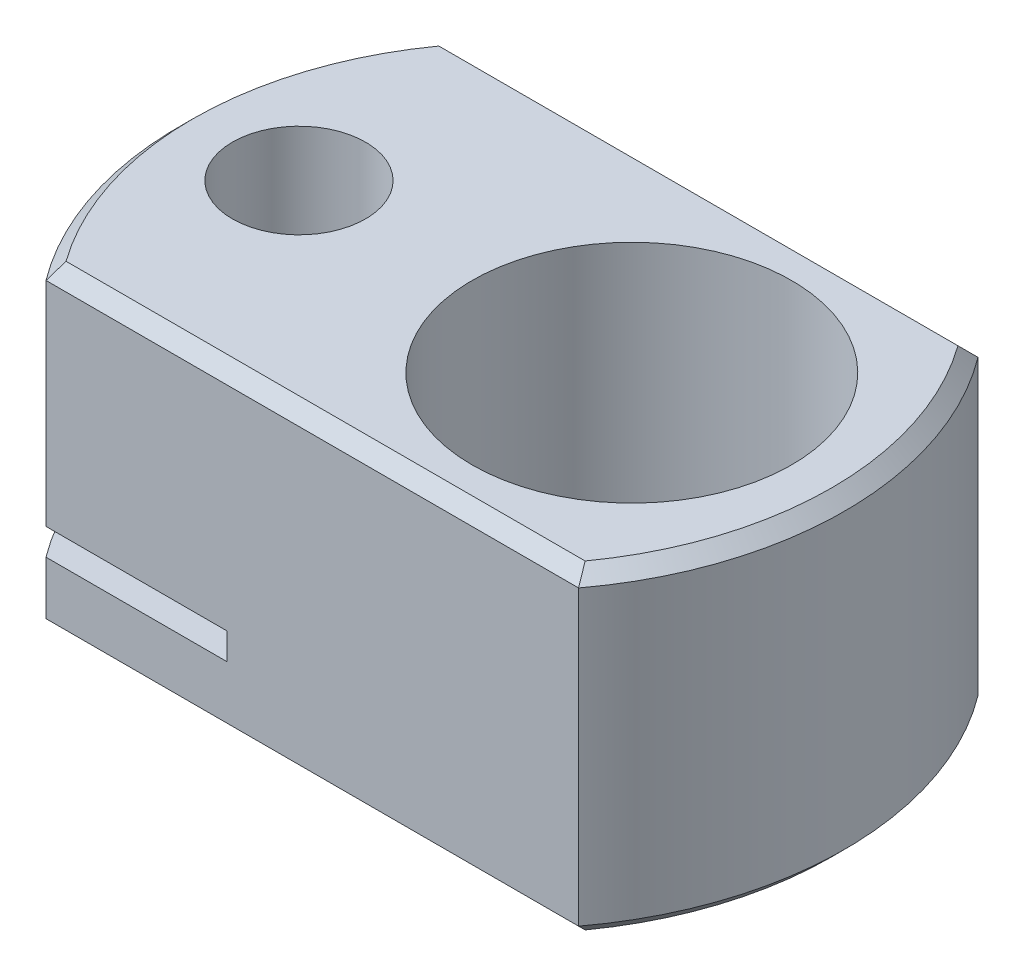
ISO-10303-21;
HEADER;
FILE_DESCRIPTION(('STEP AP214'),'2;1');
FILE_NAME('part.step','',(''),(''),'','','');
FILE_SCHEMA(('AUTOMOTIVE_DESIGN { 1 0 10303 214 1 1 1 1 }'));
ENDSEC;
DATA;
#1=APPLICATION_CONTEXT('core data for automotive mechanical design processes');
#2=APPLICATION_PROTOCOL_DEFINITION('international standard','automotive_design',2000,#1);
#3=PRODUCT_CONTEXT('',#1,'mechanical');
#4=PRODUCT('Part','Part','',(#3));
#5=PRODUCT_RELATED_PRODUCT_CATEGORY('part','',(#4));
#6=PRODUCT_DEFINITION_FORMATION('','',#4);
#7=PRODUCT_DEFINITION_CONTEXT('part definition',#1,'design');
#8=PRODUCT_DEFINITION('design','',#6,#7);
#9=PRODUCT_DEFINITION_SHAPE('','',#8);
#10=(LENGTH_UNIT() NAMED_UNIT(*) SI_UNIT(.MILLI.,.METRE.));
#11=(NAMED_UNIT(*) PLANE_ANGLE_UNIT() SI_UNIT($,.RADIAN.));
#12=(NAMED_UNIT(*) SI_UNIT($,.STERADIAN.) SOLID_ANGLE_UNIT());
#13=UNCERTAINTY_MEASURE_WITH_UNIT(LENGTH_MEASURE(1.E-05),#10,'distance_accuracy_value','');
#14=(GEOMETRIC_REPRESENTATION_CONTEXT(3) GLOBAL_UNCERTAINTY_ASSIGNED_CONTEXT((#13)) GLOBAL_UNIT_ASSIGNED_CONTEXT((#10,
#11,#12)) REPRESENTATION_CONTEXT('',''));
#15=CARTESIAN_POINT('',(0.,0.,0.));
#16=DIRECTION('',(0.,0.,1.));
#17=DIRECTION('',(1.,0.,0.));
#18=AXIS2_PLACEMENT_3D('',#15,#16,#17);
#19=CARTESIAN_POINT('',(0.,12.,0.));
#20=DIRECTION('',(0.,-1.,0.));
#21=DIRECTION('',(0.,0.,-1.));
#22=AXIS2_PLACEMENT_3D('',#19,#20,#21);
#23=CYLINDRICAL_SURFACE('',#22,12.5);
#24=DIRECTION('',(0.,-1.,0.));
#25=VECTOR('',#24,1.);
#26=CARTESIAN_POINT('',(-10.,12.,-7.50000000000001));
#27=LINE('',#26,#25);
#28=CARTESIAN_POINT('',(-10.,11.5,-7.50000000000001));
#29=VERTEX_POINT('',#28);
#30=CARTESIAN_POINT('',(-10.,3.49999999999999,-7.5));
#31=VERTEX_POINT('',#30);
#32=EDGE_CURVE('E255',#29,#31,#27,.T.);
#33=ORIENTED_EDGE('',*,*,#32,.T.);
#34=CARTESIAN_POINT('',(0.,3.5,0.));
#35=DIRECTION('',(0.,1.,0.));
#36=DIRECTION('',(-1.,0.,0.));
#37=AXIS2_PLACEMENT_3D('',#34,#35,#36);
#38=CIRCLE('',#37,12.5);
#39=CARTESIAN_POINT('',(-10.,3.49999999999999,7.50000000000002));
#40=VERTEX_POINT('',#39);
#41=EDGE_CURVE('E151',#31,#40,#38,.T.);
#42=ORIENTED_EDGE('',*,*,#41,.T.);
#43=DIRECTION('',(0.,-1.,0.));
#44=VECTOR('',#43,1.);
#45=CARTESIAN_POINT('',(-10.,12.,7.50000000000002));
#46=LINE('',#45,#44);
#47=CARTESIAN_POINT('',(-10.,11.5,7.50000000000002));
#48=VERTEX_POINT('',#47);
#49=EDGE_CURVE('E252',#48,#40,#46,.T.);
#50=ORIENTED_EDGE('',*,*,#49,.F.);
#51=CARTESIAN_POINT('',(0.,11.5,0.));
#52=DIRECTION('',(0.,1.,0.));
#53=DIRECTION('',(0.,0.,1.));
#54=AXIS2_PLACEMENT_3D('',#51,#52,#53);
#55=CIRCLE('',#54,12.5);
#56=EDGE_CURVE('E278',#48,#29,#55,.F.);
#57=ORIENTED_EDGE('',*,*,#56,.T.);
#58=EDGE_LOOP('',(#33,#42,#50,#57));
#59=FACE_BOUND('',#58,.T.);
#60=ADVANCED_FACE('F30',(#59),#23,.T.);
#61=CARTESIAN_POINT('',(-8.00000000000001,12.,0.));
#62=DIRECTION('',(0.,-1.,0.));
#63=DIRECTION('',(0.,0.,-1.));
#64=AXIS2_PLACEMENT_3D('',#61,#62,#63);
#65=CYLINDRICAL_SURFACE('',#64,2.5);
#66=CARTESIAN_POINT('',(-8.00000000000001,3.49999999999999,0.));
#67=DIRECTION('',(0.,1.,0.));
#68=DIRECTION('',(-1.,0.,0.));
#69=AXIS2_PLACEMENT_3D('',#66,#67,#68);
#70=CIRCLE('',#69,2.5);
#71=CARTESIAN_POINT('',(-10.5,3.49999999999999,0.));
#72=VERTEX_POINT('',#71);
#73=EDGE_CURVE('E147',#72,#72,#70,.T.);
#74=ORIENTED_EDGE('',*,*,#73,.F.);
#75=EDGE_LOOP('',(#74));
#76=FACE_BOUND('',#75,.T.);
#77=CARTESIAN_POINT('',(-8.00000000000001,12.,0.));
#78=DIRECTION('',(0.,1.,0.));
#79=DIRECTION('',(0.,0.,1.));
#80=AXIS2_PLACEMENT_3D('',#77,#78,#79);
#81=CIRCLE('',#80,2.5);
#82=CARTESIAN_POINT('',(-8.00000000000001,12.,2.50000000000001));
#83=VERTEX_POINT('',#82);
#84=EDGE_CURVE('E157',#83,#83,#81,.T.);
#85=ORIENTED_EDGE('',*,*,#84,.T.);
#86=EDGE_LOOP('',(#85));
#87=FACE_BOUND('',#86,.T.);
#88=ADVANCED_FACE('F301',(#76,#87),#65,.F.);
#89=CARTESIAN_POINT('',(0.,12.,0.));
#90=DIRECTION('',(0.,1.,0.));
#91=DIRECTION('',(0.,0.,1.));
#92=AXIS2_PLACEMENT_3D('',#89,#90,#91);
#93=PLANE('',#92);
#94=CARTESIAN_POINT('',(4.5,12.,0.));
#95=DIRECTION('',(0.,1.,0.));
#96=DIRECTION('',(0.,0.,1.));
#97=AXIS2_PLACEMENT_3D('',#94,#95,#96);
#98=CIRCLE('',#97,6.);
#99=CARTESIAN_POINT('',(4.5,12.,6.));
#100=VERTEX_POINT('',#99);
#101=EDGE_CURVE('E163',#100,#100,#98,.T.);
#102=ORIENTED_EDGE('',*,*,#101,.F.);
#103=EDGE_LOOP('',(#102));
#104=FACE_BOUND('',#103,.T.);
#105=CARTESIAN_POINT('',(0.,12.,0.));
#106=DIRECTION('',(0.,1.,0.));
#107=DIRECTION('',(0.,0.,1.));
#108=AXIS2_PLACEMENT_3D('',#105,#106,#107);
#109=CIRCLE('',#108,12.);
#110=CARTESIAN_POINT('',(-9.74679434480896,12.,-7.));
#111=VERTEX_POINT('',#110);
#112=CARTESIAN_POINT('',(-9.74679434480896,12.,7.));
#113=VERTEX_POINT('',#112);
#114=EDGE_CURVE('E265',#111,#113,#109,.T.);
#115=ORIENTED_EDGE('',*,*,#114,.T.);
#116=DIRECTION('',(1.,0.,0.));
#117=VECTOR('',#116,1.);
#118=CARTESIAN_POINT('',(10.,12.,7.00000000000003));
#119=LINE('',#118,#117);
#120=CARTESIAN_POINT('',(9.74679434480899,12.,7.00000000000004));
#121=VERTEX_POINT('',#120);
#122=EDGE_CURVE('E267',#113,#121,#119,.T.);
#123=ORIENTED_EDGE('',*,*,#122,.T.);
#124=CARTESIAN_POINT('',(0.,12.,0.));
#125=DIRECTION('',(0.,1.,0.));
#126=DIRECTION('',(0.,0.,1.));
#127=AXIS2_PLACEMENT_3D('',#124,#125,#126);
#128=CIRCLE('',#127,12.);
#129=CARTESIAN_POINT('',(9.74679434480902,12.,-7.00000000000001));
#130=VERTEX_POINT('',#129);
#131=EDGE_CURVE('E261',#121,#130,#128,.T.);
#132=ORIENTED_EDGE('',*,*,#131,.T.);
#133=DIRECTION('',(-1.,0.,0.));
#134=VECTOR('',#133,1.);
#135=CARTESIAN_POINT('',(-9.99999999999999,12.,-7.));
#136=LINE('',#135,#134);
#137=EDGE_CURVE('E263',#130,#111,#136,.T.);
#138=ORIENTED_EDGE('',*,*,#137,.T.);
#139=EDGE_LOOP('',(#115,#123,#132,#138));
#140=FACE_BOUND('',#139,.T.);
#141=ORIENTED_EDGE('',*,*,#84,.F.);
#142=EDGE_LOOP('',(#141));
#143=FACE_BOUND('',#142,.T.);
#144=ADVANCED_FACE('F304',(#104,#140,#143),#93,.T.);
#145=CARTESIAN_POINT('',(0.,0.,0.));
#146=DIRECTION('',(0.,1.,0.));
#147=DIRECTION('',(0.,0.,1.));
#148=AXIS2_PLACEMENT_3D('',#145,#146,#147);
#149=PLANE('',#148);
#150=CARTESIAN_POINT('',(4.5,0.,0.));
#151=DIRECTION('',(0.,1.,0.));
#152=DIRECTION('',(0.,0.,1.));
#153=AXIS2_PLACEMENT_3D('',#150,#151,#152);
#154=CIRCLE('',#153,6.);
#155=CARTESIAN_POINT('',(4.5,0.,6.));
#156=VERTEX_POINT('',#155);
#157=EDGE_CURVE('E160',#156,#156,#154,.T.);
#158=ORIENTED_EDGE('',*,*,#157,.T.);
#159=EDGE_LOOP('',(#158));
#160=FACE_BOUND('',#159,.T.);
#161=CARTESIAN_POINT('',(0.,0.,0.));
#162=DIRECTION('',(0.,1.,0.));
#163=DIRECTION('',(0.,0.,1.));
#164=AXIS2_PLACEMENT_3D('',#161,#162,#163);
#165=CIRCLE('',#164,12.);
#166=CARTESIAN_POINT('',(-9.74679434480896,0.,7.));
#167=VERTEX_POINT('',#166);
#168=CARTESIAN_POINT('',(-9.74679434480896,0.,-7.));
#169=VERTEX_POINT('',#168);
#170=EDGE_CURVE('E53',#167,#169,#165,.F.);
#171=ORIENTED_EDGE('',*,*,#170,.T.);
#172=DIRECTION('',(1.,0.,0.));
#173=VECTOR('',#172,1.);
#174=CARTESIAN_POINT('',(0.,0.,-7.));
#175=LINE('',#174,#173);
#176=CARTESIAN_POINT('',(9.74679434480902,0.,-7.00000000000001));
#177=VERTEX_POINT('',#176);
#178=EDGE_CURVE('E38',#169,#177,#175,.T.);
#179=ORIENTED_EDGE('',*,*,#178,.T.);
#180=CARTESIAN_POINT('',(0.,0.,0.));
#181=DIRECTION('',(0.,1.,0.));
#182=DIRECTION('',(0.,0.,1.));
#183=AXIS2_PLACEMENT_3D('',#180,#181,#182);
#184=CIRCLE('',#183,12.);
#185=CARTESIAN_POINT('',(9.74679434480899,0.,7.00000000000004));
#186=VERTEX_POINT('',#185);
#187=EDGE_CURVE('E288',#177,#186,#184,.F.);
#188=ORIENTED_EDGE('',*,*,#187,.T.);
#189=DIRECTION('',(-1.,0.,0.));
#190=VECTOR('',#189,1.);
#191=CARTESIAN_POINT('',(0.,0.,7.));
#192=LINE('',#191,#190);
#193=EDGE_CURVE('E290',#186,#167,#192,.T.);
#194=ORIENTED_EDGE('',*,*,#193,.T.);
#195=EDGE_LOOP('',(#171,#179,#188,#194));
#196=FACE_BOUND('',#195,.T.);
#197=CARTESIAN_POINT('',(-8.00000000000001,0.,0.));
#198=DIRECTION('',(0.,1.,0.));
#199=DIRECTION('',(0.,0.,1.));
#200=AXIS2_PLACEMENT_3D('',#197,#198,#199);
#201=CIRCLE('',#200,2.5);
#202=CARTESIAN_POINT('',(-8.00000000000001,0.,2.50000000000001));
#203=VERTEX_POINT('',#202);
#204=EDGE_CURVE('E154',#203,#203,#201,.T.);
#205=ORIENTED_EDGE('',*,*,#204,.T.);
#206=EDGE_LOOP('',(#205));
#207=FACE_BOUND('',#206,.T.);
#208=ADVANCED_FACE('F310',(#160,#196,#207),#149,.F.);
#209=CARTESIAN_POINT('',(0.,12.,0.));
#210=DIRECTION('',(0.,-1.,0.));
#211=DIRECTION('',(0.,0.,-1.));
#212=AXIS2_PLACEMENT_3D('',#209,#210,#211);
#213=CYLINDRICAL_SURFACE('',#212,12.5);
#214=DIRECTION('',(0.,-1.,0.));
#215=VECTOR('',#214,1.);
#216=CARTESIAN_POINT('',(10.,12.,-7.5));
#217=LINE('',#216,#215);
#218=CARTESIAN_POINT('',(10.,11.5,-7.5));
#219=VERTEX_POINT('',#218);
#220=CARTESIAN_POINT('',(10.,0.5,-7.5));
#221=VERTEX_POINT('',#220);
#222=EDGE_CURVE('E258',#219,#221,#217,.T.);
#223=ORIENTED_EDGE('',*,*,#222,.F.);
#224=CARTESIAN_POINT('',(0.,11.5,0.));
#225=DIRECTION('',(0.,1.,0.));
#226=DIRECTION('',(0.,0.,1.));
#227=AXIS2_PLACEMENT_3D('',#224,#225,#226);
#228=CIRCLE('',#227,12.5);
#229=CARTESIAN_POINT('',(10.,11.5,7.50000000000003));
#230=VERTEX_POINT('',#229);
#231=EDGE_CURVE('E286',#219,#230,#228,.F.);
#232=ORIENTED_EDGE('',*,*,#231,.T.);
#233=DIRECTION('',(0.,-1.,0.));
#234=VECTOR('',#233,1.);
#235=CARTESIAN_POINT('',(10.,12.,7.50000000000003));
#236=LINE('',#235,#234);
#237=CARTESIAN_POINT('',(10.,0.5,7.50000000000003));
#238=VERTEX_POINT('',#237);
#239=EDGE_CURVE('E244',#230,#238,#236,.T.);
#240=ORIENTED_EDGE('',*,*,#239,.T.);
#241=CARTESIAN_POINT('',(0.,0.5,0.));
#242=DIRECTION('',(0.,1.,0.));
#243=DIRECTION('',(0.,0.,1.));
#244=AXIS2_PLACEMENT_3D('',#241,#242,#243);
#245=CIRCLE('',#244,12.5);
#246=EDGE_CURVE('E284',#238,#221,#245,.T.);
#247=ORIENTED_EDGE('',*,*,#246,.T.);
#248=EDGE_LOOP('',(#223,#232,#240,#247));
#249=FACE_BOUND('',#248,.T.);
#250=ADVANCED_FACE('F32',(#249),#213,.T.);
#251=CARTESIAN_POINT('',(-10.,12.,-7.5));
#252=DIRECTION('',(0.,0.,1.));
#253=DIRECTION('',(1.,0.,0.));
#254=AXIS2_PLACEMENT_3D('',#251,#252,#253);
#255=PLANE('',#254);
#256=DIRECTION('',(0.,1.,0.));
#257=VECTOR('',#256,1.);
#258=CARTESIAN_POINT('',(-3.1971816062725,3.49999999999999,-7.50000000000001));
#259=LINE('',#258,#257);
#260=CARTESIAN_POINT('',(-3.1971816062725,2.5,-7.50000000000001));
#261=VERTEX_POINT('',#260);
#262=CARTESIAN_POINT('',(-3.1971816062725,3.49999999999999,-7.50000000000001));
#263=VERTEX_POINT('',#262);
#264=EDGE_CURVE('E129',#261,#263,#259,.T.);
#265=ORIENTED_EDGE('',*,*,#264,.T.);
#266=DIRECTION('',(-1.,0.,0.));
#267=VECTOR('',#266,1.);
#268=CARTESIAN_POINT('',(-15.1971816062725,3.49999999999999,-7.50000000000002));
#269=LINE('',#268,#267);
#270=EDGE_CURVE('E126',#263,#31,#269,.T.);
#271=ORIENTED_EDGE('',*,*,#270,.T.);
#272=ORIENTED_EDGE('',*,*,#32,.F.);
#273=DIRECTION('',(1.,0.,0.));
#274=VECTOR('',#273,1.);
#275=CARTESIAN_POINT('',(10.,11.5,-7.5));
#276=LINE('',#275,#274);
#277=EDGE_CURVE('E282',#29,#219,#276,.T.);
#278=ORIENTED_EDGE('',*,*,#277,.T.);
#279=ORIENTED_EDGE('',*,*,#222,.T.);
#280=DIRECTION('',(-1.,0.,0.));
#281=VECTOR('',#280,1.);
#282=CARTESIAN_POINT('',(-10.,0.5,-7.5));
#283=LINE('',#282,#281);
#284=CARTESIAN_POINT('',(-10.,0.5,-7.50000000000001));
#285=VERTEX_POINT('',#284);
#286=EDGE_CURVE('E280',#221,#285,#283,.T.);
#287=ORIENTED_EDGE('',*,*,#286,.T.);
#288=CARTESIAN_POINT('',(-10.,2.5,-7.5));
#289=VERTEX_POINT('',#288);
#290=EDGE_CURVE('E139',#289,#285,#27,.T.);
#291=ORIENTED_EDGE('',*,*,#290,.F.);
#292=DIRECTION('',(1.,0.,0.));
#293=VECTOR('',#292,1.);
#294=CARTESIAN_POINT('',(-15.1971816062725,2.49999999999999,-7.50000000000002));
#295=LINE('',#294,#293);
#296=EDGE_CURVE('E122',#289,#261,#295,.T.);
#297=ORIENTED_EDGE('',*,*,#296,.T.);
#298=EDGE_LOOP('',(#265,#271,#272,#278,#279,#287,#291,#297));
#299=FACE_BOUND('',#298,.T.);
#300=ADVANCED_FACE('F137',(#299),#255,.F.);
#301=CARTESIAN_POINT('',(-10.,2.5,7.50000000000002));
#302=VERTEX_POINT('',#301);
#303=CARTESIAN_POINT('',(-10.,0.5,7.50000000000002));
#304=VERTEX_POINT('',#303);
#305=EDGE_CURVE('E251',#302,#304,#46,.T.);
#306=ORIENTED_EDGE('',*,*,#305,.F.);
#307=CARTESIAN_POINT('',(0.,2.5,0.));
#308=DIRECTION('',(0.,-1.,0.));
#309=DIRECTION('',(1.,0.,0.));
#310=AXIS2_PLACEMENT_3D('',#307,#308,#309);
#311=CIRCLE('',#310,12.5);
#312=EDGE_CURVE('E45',#302,#289,#311,.T.);
#313=ORIENTED_EDGE('',*,*,#312,.T.);
#314=ORIENTED_EDGE('',*,*,#290,.T.);
#315=CARTESIAN_POINT('',(0.,0.5,0.));
#316=DIRECTION('',(0.,1.,0.));
#317=DIRECTION('',(0.,0.,1.));
#318=AXIS2_PLACEMENT_3D('',#315,#316,#317);
#319=CIRCLE('',#318,12.5);
#320=EDGE_CURVE('E275',#285,#304,#319,.T.);
#321=ORIENTED_EDGE('',*,*,#320,.T.);
#322=EDGE_LOOP('',(#306,#313,#314,#321));
#323=FACE_BOUND('',#322,.T.);
#324=ADVANCED_FACE('F323',(#323),#23,.T.);
#325=CARTESIAN_POINT('',(-10.,12.,7.50000000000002));
#326=DIRECTION('',(0.,0.,-1.));
#327=DIRECTION('',(-1.,0.,0.));
#328=AXIS2_PLACEMENT_3D('',#325,#326,#327);
#329=PLANE('',#328);
#330=ORIENTED_EDGE('',*,*,#49,.T.);
#331=DIRECTION('',(1.,0.,0.));
#332=VECTOR('',#331,1.);
#333=CARTESIAN_POINT('',(-10.,3.49999999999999,7.50000000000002));
#334=LINE('',#333,#332);
#335=CARTESIAN_POINT('',(-3.19718160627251,3.49999999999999,7.50000000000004));
#336=VERTEX_POINT('',#335);
#337=EDGE_CURVE('E148',#40,#336,#334,.T.);
#338=ORIENTED_EDGE('',*,*,#337,.T.);
#339=DIRECTION('',(0.,-1.,0.));
#340=VECTOR('',#339,1.);
#341=CARTESIAN_POINT('',(-3.19718160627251,12.,7.50000000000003));
#342=LINE('',#341,#340);
#343=CARTESIAN_POINT('',(-3.19718160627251,2.5,7.50000000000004));
#344=VERTEX_POINT('',#343);
#345=EDGE_CURVE('E11',#336,#344,#342,.T.);
#346=ORIENTED_EDGE('',*,*,#345,.T.);
#347=DIRECTION('',(-1.,0.,0.));
#348=VECTOR('',#347,1.);
#349=CARTESIAN_POINT('',(-9.99999999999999,2.5,7.50000000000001));
#350=LINE('',#349,#348);
#351=EDGE_CURVE('E123',#344,#302,#350,.T.);
#352=ORIENTED_EDGE('',*,*,#351,.T.);
#353=ORIENTED_EDGE('',*,*,#305,.T.);
#354=DIRECTION('',(1.,0.,0.));
#355=VECTOR('',#354,1.);
#356=CARTESIAN_POINT('',(-10.,0.5,7.50000000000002));
#357=LINE('',#356,#355);
#358=EDGE_CURVE('E270',#304,#238,#357,.T.);
#359=ORIENTED_EDGE('',*,*,#358,.T.);
#360=ORIENTED_EDGE('',*,*,#239,.F.);
#361=DIRECTION('',(-1.,0.,0.));
#362=VECTOR('',#361,1.);
#363=CARTESIAN_POINT('',(-10.,11.5,7.50000000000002));
#364=LINE('',#363,#362);
#365=EDGE_CURVE('E272',#230,#48,#364,.T.);
#366=ORIENTED_EDGE('',*,*,#365,.T.);
#367=EDGE_LOOP('',(#330,#338,#346,#352,#353,#359,#360,#366));
#368=FACE_BOUND('',#367,.T.);
#369=ADVANCED_FACE('F327',(#368),#329,.F.);
#370=CARTESIAN_POINT('',(0.,12.,-7.));
#371=DIRECTION('',(0.,0.707106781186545,-0.707106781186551));
#372=DIRECTION('',(0.,0.70710678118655,0.707106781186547));
#373=AXIS2_PLACEMENT_3D('',#370,#371,#372);
#374=PLANE('',#373);
#375=CARTESIAN_POINT('',(10.,11.5,-7.5));
#376=CARTESIAN_POINT('',(9.95827867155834,11.583454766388,-7.41654523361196));
#377=CARTESIAN_POINT('',(9.91631753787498,11.6668488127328,-7.33315118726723));
#378=CARTESIAN_POINT('',(9.83191565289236,11.83351547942,-7.16648452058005));
#379=CARTESIAN_POINT('',(9.78947490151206,11.9167880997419,-7.08321190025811));
#380=CARTESIAN_POINT('',(9.74679434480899,12.,-7.00000000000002));
#381=B_SPLINE_CURVE_WITH_KNOTS('',3,(#375,#376,#377,#378,#379,#380),.UNSPECIFIED.,.F.,.F.,(4,2,
4),(0.,0.375538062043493,0.751076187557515),.UNSPECIFIED.);
#382=EDGE_CURVE('E245',#219,#130,#381,.T.);
#383=ORIENTED_EDGE('',*,*,#382,.F.);
#384=ORIENTED_EDGE('',*,*,#277,.F.);
#385=CARTESIAN_POINT('',(-10.,11.5,-7.50000000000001));
#386=CARTESIAN_POINT('',(-9.95827867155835,11.583454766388,-7.41654523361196));
#387=CARTESIAN_POINT('',(-9.91631753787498,11.6668488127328,-7.33315118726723));
#388=CARTESIAN_POINT('',(-9.83191565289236,11.83351547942,-7.16648452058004));
#389=CARTESIAN_POINT('',(-9.78947490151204,11.9167880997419,-7.0832119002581));
#390=CARTESIAN_POINT('',(-9.74679434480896,12.,-7.));
#391=B_SPLINE_CURVE_WITH_KNOTS('',3,(#385,#386,#387,#388,#389,#390),.UNSPECIFIED.,.F.,.F.,(4,2,
4),(0.,0.375538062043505,0.751076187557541),.UNSPECIFIED.);
#392=EDGE_CURVE('E238',#111,#29,#391,.F.);
#393=ORIENTED_EDGE('',*,*,#392,.F.);
#394=ORIENTED_EDGE('',*,*,#137,.F.);
#395=EDGE_LOOP('',(#383,#384,#393,#394));
#396=FACE_BOUND('',#395,.T.);
#397=ADVANCED_FACE('F232',(#396),#374,.T.);
#398=CARTESIAN_POINT('',(0.,12.,0.));
#399=DIRECTION('',(0.,-1.,0.));
#400=DIRECTION('',(0.,0.,-1.));
#401=AXIS2_PLACEMENT_3D('',#398,#399,#400);
#402=CONICAL_SURFACE('',#401,12.,0.785398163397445);
#403=ORIENTED_EDGE('',*,*,#392,.T.);
#404=ORIENTED_EDGE('',*,*,#56,.F.);
#405=CARTESIAN_POINT('',(-10.,11.5,7.50000000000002));
#406=CARTESIAN_POINT('',(-9.95827867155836,11.583454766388,7.41654523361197));
#407=CARTESIAN_POINT('',(-9.91631753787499,11.6668488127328,7.33315118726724));
#408=CARTESIAN_POINT('',(-9.83191565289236,11.83351547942,7.16648452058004));
#409=CARTESIAN_POINT('',(-9.78947490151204,11.9167880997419,7.0832119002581));
#410=CARTESIAN_POINT('',(-9.74679434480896,12.,7.));
#411=B_SPLINE_CURVE_WITH_KNOTS('',3,(#405,#406,#407,#408,#409,#410),.UNSPECIFIED.,.F.,.F.,(4,2,
4),(0.,0.375538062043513,0.751076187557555),.UNSPECIFIED.);
#412=EDGE_CURVE('E215',#113,#48,#411,.F.);
#413=ORIENTED_EDGE('',*,*,#412,.F.);
#414=ORIENTED_EDGE('',*,*,#114,.F.);
#415=EDGE_LOOP('',(#403,#404,#413,#414));
#416=FACE_BOUND('',#415,.T.);
#417=ADVANCED_FACE('F227',(#416),#402,.T.);
#418=CARTESIAN_POINT('',(0.,12.,0.));
#419=DIRECTION('',(0.,-1.,0.));
#420=DIRECTION('',(0.,0.,-1.));
#421=AXIS2_PLACEMENT_3D('',#418,#419,#420);
#422=CONICAL_SURFACE('',#421,12.,0.785398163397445);
#423=ORIENTED_EDGE('',*,*,#382,.T.);
#424=ORIENTED_EDGE('',*,*,#131,.F.);
#425=CARTESIAN_POINT('',(9.74679434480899,12.,7.00000000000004));
#426=CARTESIAN_POINT('',(9.78947490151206,11.9167880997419,7.08321190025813));
#427=CARTESIAN_POINT('',(9.83191565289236,11.8335154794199,7.16648452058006));
#428=CARTESIAN_POINT('',(9.91631753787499,11.6668488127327,7.33315118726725));
#429=CARTESIAN_POINT('',(9.95827867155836,11.583454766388,7.41654523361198));
#430=CARTESIAN_POINT('',(10.,11.5,7.50000000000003));
#431=B_SPLINE_CURVE_WITH_KNOTS('',3,(#425,#426,#427,#428,#429,#430),.UNSPECIFIED.,.F.,.F.,(4,2,
4),(0.,0.375538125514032,0.751076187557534),.UNSPECIFIED.);
#432=EDGE_CURVE('E205',#230,#121,#431,.F.);
#433=ORIENTED_EDGE('',*,*,#432,.F.);
#434=ORIENTED_EDGE('',*,*,#231,.F.);
#435=EDGE_LOOP('',(#423,#424,#433,#434));
#436=FACE_BOUND('',#435,.T.);
#437=ADVANCED_FACE('F221',(#436),#422,.T.);
#438=CARTESIAN_POINT('',(0.,12.,7.));
#439=DIRECTION('',(0.,0.707106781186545,0.707106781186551));
#440=DIRECTION('',(0.,-0.70710678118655,0.707106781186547));
#441=AXIS2_PLACEMENT_3D('',#438,#439,#440);
#442=PLANE('',#441);
#443=ORIENTED_EDGE('',*,*,#412,.T.);
#444=ORIENTED_EDGE('',*,*,#365,.F.);
#445=ORIENTED_EDGE('',*,*,#432,.T.);
#446=ORIENTED_EDGE('',*,*,#122,.F.);
#447=EDGE_LOOP('',(#443,#444,#445,#446));
#448=FACE_BOUND('',#447,.T.);
#449=ADVANCED_FACE('F223',(#448),#442,.T.);
#450=CARTESIAN_POINT('',(-10.,0.5,7.50000000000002));
#451=DIRECTION('',(0.,0.70710678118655,-0.707106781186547));
#452=DIRECTION('',(0.,0.707106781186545,0.707106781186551));
#453=AXIS2_PLACEMENT_3D('',#450,#451,#452);
#454=PLANE('',#453);
#455=CARTESIAN_POINT('',(-10.,0.5,7.50000000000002));
#456=CARTESIAN_POINT('',(-9.95827867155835,0.41654523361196,7.41654523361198));
#457=CARTESIAN_POINT('',(-9.91631753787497,0.333151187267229,7.33315118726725));
#458=CARTESIAN_POINT('',(-9.83191565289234,0.166484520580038,7.16648452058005));
#459=CARTESIAN_POINT('',(-9.78947490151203,0.0832119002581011,7.08321190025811));
#460=CARTESIAN_POINT('',(-9.74679434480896,0.,7.));
#461=B_SPLINE_CURVE_WITH_KNOTS('',3,(#455,#456,#457,#458,#459,#460),.UNSPECIFIED.,.F.,.F.,(4,2,
4),(0.,0.375538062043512,0.751076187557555),.UNSPECIFIED.);
#462=EDGE_CURVE('E206',#167,#304,#461,.F.);
#463=ORIENTED_EDGE('',*,*,#462,.F.);
#464=ORIENTED_EDGE('',*,*,#193,.F.);
#465=CARTESIAN_POINT('',(10.,0.5,7.50000000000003));
#466=CARTESIAN_POINT('',(9.95827867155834,0.416545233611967,7.416545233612));
#467=CARTESIAN_POINT('',(9.91631753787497,0.33315118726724,7.33315118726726));
#468=CARTESIAN_POINT('',(9.83191565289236,0.166484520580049,7.16648452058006));
#469=CARTESIAN_POINT('',(9.78947490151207,0.0832119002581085,7.08321190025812));
#470=CARTESIAN_POINT('',(9.74679434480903,0.,7.));
#471=B_SPLINE_CURVE_WITH_KNOTS('',3,(#465,#466,#467,#468,#469,#470),.UNSPECIFIED.,.F.,.F.,(4,2,
4),(0.,0.375538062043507,0.751076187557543),.UNSPECIFIED.);
#472=EDGE_CURVE('E199',#238,#186,#471,.T.);
#473=ORIENTED_EDGE('',*,*,#472,.F.);
#474=ORIENTED_EDGE('',*,*,#358,.F.);
#475=EDGE_LOOP('',(#463,#464,#473,#474));
#476=FACE_BOUND('',#475,.T.);
#477=ADVANCED_FACE('F193',(#476),#454,.F.);
#478=CARTESIAN_POINT('',(0.,0.5,0.));
#479=DIRECTION('',(0.,1.,0.));
#480=DIRECTION('',(0.,0.,1.));
#481=AXIS2_PLACEMENT_3D('',#478,#479,#480);
#482=CONICAL_SURFACE('',#481,12.5,0.785398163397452);
#483=ORIENTED_EDGE('',*,*,#472,.T.);
#484=ORIENTED_EDGE('',*,*,#187,.F.);
#485=CARTESIAN_POINT('',(9.74679434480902,0.,-7.00000000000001));
#486=CARTESIAN_POINT('',(9.78947490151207,0.0832119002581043,-7.08321190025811));
#487=CARTESIAN_POINT('',(9.83191565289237,0.166484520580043,-7.16648452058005));
#488=CARTESIAN_POINT('',(9.91631753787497,0.333151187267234,-7.33315118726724));
#489=CARTESIAN_POINT('',(9.95827867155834,0.416545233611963,-7.41654523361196));
#490=CARTESIAN_POINT('',(10.,0.5,-7.5));
#491=B_SPLINE_CURVE_WITH_KNOTS('',3,(#485,#486,#487,#488,#489,#490),.UNSPECIFIED.,.F.,.F.,(4,2,
4),(0.,0.375538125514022,0.751076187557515),.UNSPECIFIED.);
#492=EDGE_CURVE('E174',#221,#177,#491,.F.);
#493=ORIENTED_EDGE('',*,*,#492,.F.);
#494=ORIENTED_EDGE('',*,*,#246,.F.);
#495=EDGE_LOOP('',(#483,#484,#493,#494));
#496=FACE_BOUND('',#495,.T.);
#497=ADVANCED_FACE('F188',(#496),#482,.T.);
#498=CARTESIAN_POINT('',(0.,0.5,0.));
#499=DIRECTION('',(0.,1.,0.));
#500=DIRECTION('',(0.,0.,1.));
#501=AXIS2_PLACEMENT_3D('',#498,#499,#500);
#502=CONICAL_SURFACE('',#501,12.5,0.785398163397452);
#503=ORIENTED_EDGE('',*,*,#462,.T.);
#504=ORIENTED_EDGE('',*,*,#320,.F.);
#505=CARTESIAN_POINT('',(-10.,0.5,-7.50000000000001));
#506=CARTESIAN_POINT('',(-9.95827867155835,0.416545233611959,-7.41654523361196));
#507=CARTESIAN_POINT('',(-9.91631753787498,0.333151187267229,-7.33315118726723));
#508=CARTESIAN_POINT('',(-9.83191565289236,0.166484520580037,-7.16648452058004));
#509=CARTESIAN_POINT('',(-9.78947490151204,0.0832119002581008,-7.0832119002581));
#510=CARTESIAN_POINT('',(-9.74679434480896,0.,-7.));
#511=B_SPLINE_CURVE_WITH_KNOTS('',3,(#505,#506,#507,#508,#509,#510),.UNSPECIFIED.,.F.,.F.,(4,2,
4),(0.,0.375538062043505,0.751076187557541),.UNSPECIFIED.);
#512=EDGE_CURVE('E166',#169,#285,#511,.F.);
#513=ORIENTED_EDGE('',*,*,#512,.F.);
#514=ORIENTED_EDGE('',*,*,#170,.F.);
#515=EDGE_LOOP('',(#503,#504,#513,#514));
#516=FACE_BOUND('',#515,.T.);
#517=ADVANCED_FACE('F180',(#516),#502,.T.);
#518=CARTESIAN_POINT('',(-10.,0.5,-7.5));
#519=DIRECTION('',(0.,0.70710678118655,0.707106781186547));
#520=DIRECTION('',(0.,-0.707106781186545,0.707106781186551));
#521=AXIS2_PLACEMENT_3D('',#518,#519,#520);
#522=PLANE('',#521);
#523=ORIENTED_EDGE('',*,*,#492,.T.);
#524=ORIENTED_EDGE('',*,*,#178,.F.);
#525=ORIENTED_EDGE('',*,*,#512,.T.);
#526=ORIENTED_EDGE('',*,*,#286,.F.);
#527=EDGE_LOOP('',(#523,#524,#525,#526));
#528=FACE_BOUND('',#527,.T.);
#529=ADVANCED_FACE('F183',(#528),#522,.F.);
#530=CARTESIAN_POINT('',(4.5,12.,0.));
#531=DIRECTION('',(0.,-1.,0.));
#532=DIRECTION('',(0.,0.,-1.));
#533=AXIS2_PLACEMENT_3D('',#530,#531,#532);
#534=CYLINDRICAL_SURFACE('',#533,6.);
#535=ORIENTED_EDGE('',*,*,#101,.T.);
#536=EDGE_LOOP('',(#535));
#537=FACE_BOUND('',#536,.T.);
#538=ORIENTED_EDGE('',*,*,#157,.F.);
#539=EDGE_LOOP('',(#538));
#540=FACE_BOUND('',#539,.T.);
#541=ADVANCED_FACE('F186',(#537,#540),#534,.F.);
#542=CARTESIAN_POINT('',(-8.00000000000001,2.5,0.));
#543=DIRECTION('',(0.,-1.,0.));
#544=DIRECTION('',(1.,0.,0.));
#545=AXIS2_PLACEMENT_3D('',#542,#543,#544);
#546=CIRCLE('',#545,2.5);
#547=CARTESIAN_POINT('',(-5.5,2.5,0.));
#548=VERTEX_POINT('',#547);
#549=EDGE_CURVE('E143',#548,#548,#546,.T.);
#550=ORIENTED_EDGE('',*,*,#549,.F.);
#551=EDGE_LOOP('',(#550));
#552=FACE_BOUND('',#551,.T.);
#553=ORIENTED_EDGE('',*,*,#204,.F.);
#554=EDGE_LOOP('',(#553));
#555=FACE_BOUND('',#554,.T.);
#556=ADVANCED_FACE('F306',(#552,#555),#65,.F.);
#557=CARTESIAN_POINT('',(-3.1971816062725,3.49999999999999,-7.50000000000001));
#558=DIRECTION('',(1.,0.,0.));
#559=DIRECTION('',(0.,1.,0.));
#560=AXIS2_PLACEMENT_3D('',#557,#558,#559);
#561=PLANE('',#560);
#562=DIRECTION('',(0.,0.,1.));
#563=VECTOR('',#562,1.);
#564=CARTESIAN_POINT('',(-3.1971816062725,3.49999999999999,-7.50000000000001));
#565=LINE('',#564,#563);
#566=EDGE_CURVE('E125',#263,#336,#565,.T.);
#567=ORIENTED_EDGE('',*,*,#566,.F.);
#568=ORIENTED_EDGE('',*,*,#264,.F.);
#569=DIRECTION('',(0.,0.,1.));
#570=VECTOR('',#569,1.);
#571=CARTESIAN_POINT('',(-3.1971816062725,2.5,-7.50000000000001));
#572=LINE('',#571,#570);
#573=EDGE_CURVE('E118',#261,#344,#572,.T.);
#574=ORIENTED_EDGE('',*,*,#573,.T.);
#575=ORIENTED_EDGE('',*,*,#345,.F.);
#576=EDGE_LOOP('',(#567,#568,#574,#575));
#577=FACE_BOUND('',#576,.T.);
#578=ADVANCED_FACE('F130',(#577),#561,.F.);
#579=CARTESIAN_POINT('',(-15.1971816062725,3.49999999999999,-7.50000000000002));
#580=DIRECTION('',(0.,1.,0.));
#581=DIRECTION('',(-1.,0.,0.));
#582=AXIS2_PLACEMENT_3D('',#579,#580,#581);
#583=PLANE('',#582);
#584=ORIENTED_EDGE('',*,*,#73,.T.);
#585=EDGE_LOOP('',(#584));
#586=FACE_BOUND('',#585,.T.);
#587=ORIENTED_EDGE('',*,*,#270,.F.);
#588=ORIENTED_EDGE('',*,*,#566,.T.);
#589=ORIENTED_EDGE('',*,*,#337,.F.);
#590=ORIENTED_EDGE('',*,*,#41,.F.);
#591=EDGE_LOOP('',(#587,#588,#589,#590));
#592=FACE_BOUND('',#591,.T.);
#593=ADVANCED_FACE('F298',(#586,#592),#583,.F.);
#594=CARTESIAN_POINT('',(-15.1971816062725,2.49999999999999,-7.50000000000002));
#595=DIRECTION('',(0.,-1.,0.));
#596=DIRECTION('',(1.,0.,0.));
#597=AXIS2_PLACEMENT_3D('',#594,#595,#596);
#598=PLANE('',#597);
#599=ORIENTED_EDGE('',*,*,#549,.T.);
#600=EDGE_LOOP('',(#599));
#601=FACE_BOUND('',#600,.T.);
#602=ORIENTED_EDGE('',*,*,#351,.F.);
#603=ORIENTED_EDGE('',*,*,#573,.F.);
#604=ORIENTED_EDGE('',*,*,#296,.F.);
#605=ORIENTED_EDGE('',*,*,#312,.F.);
#606=EDGE_LOOP('',(#602,#603,#604,#605));
#607=FACE_BOUND('',#606,.T.);
#608=ADVANCED_FACE('F120',(#601,#607),#598,.F.);
#609=CLOSED_SHELL('',(#60,#88,#144,#208,#250,#300,#324,#369,#397,#417,#437,#449,#477,#497,#517,
#529,#541,#556,#578,#593,#608));
#610=MANIFOLD_SOLID_BREP('B2',#609);
#611=ADVANCED_BREP_SHAPE_REPRESENTATION('',(#18,#610),#14);
#612=SHAPE_DEFINITION_REPRESENTATION(#9,#611);
ENDSEC;
END-ISO-10303-21;
